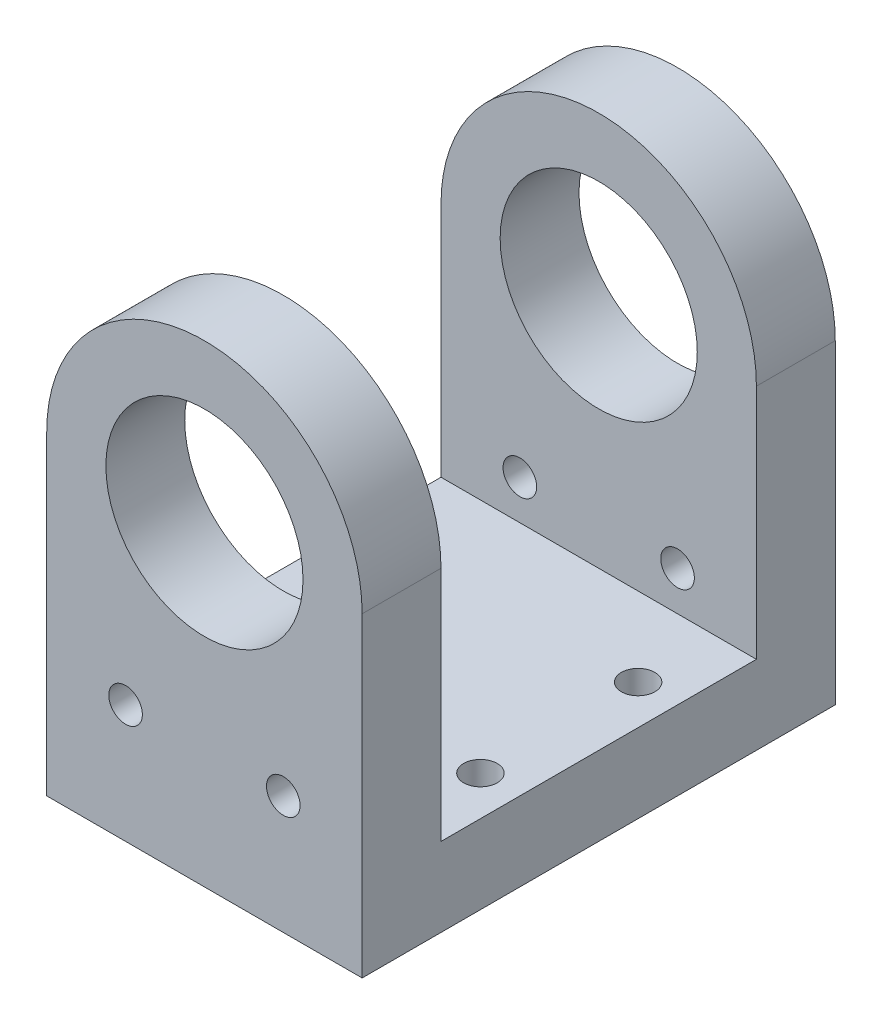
ISO-10303-21;
HEADER;
FILE_DESCRIPTION(('STEP AP214'),'2;1');
FILE_NAME('part.step','',(''),(''),'','','');
FILE_SCHEMA(('AUTOMOTIVE_DESIGN { 1 0 10303 214 1 1 1 1 }'));
ENDSEC;
DATA;
#1=APPLICATION_CONTEXT('core data for automotive mechanical design processes');
#2=APPLICATION_PROTOCOL_DEFINITION('international standard','automotive_design',2000,#1);
#3=PRODUCT_CONTEXT('',#1,'mechanical');
#4=PRODUCT('Part','Part','',(#3));
#5=PRODUCT_RELATED_PRODUCT_CATEGORY('part','',(#4));
#6=PRODUCT_DEFINITION_FORMATION('','',#4);
#7=PRODUCT_DEFINITION_CONTEXT('part definition',#1,'design');
#8=PRODUCT_DEFINITION('design','',#6,#7);
#9=PRODUCT_DEFINITION_SHAPE('','',#8);
#10=(LENGTH_UNIT() NAMED_UNIT(*) SI_UNIT(.MILLI.,.METRE.));
#11=(NAMED_UNIT(*) PLANE_ANGLE_UNIT() SI_UNIT($,.RADIAN.));
#12=(NAMED_UNIT(*) SI_UNIT($,.STERADIAN.) SOLID_ANGLE_UNIT());
#13=UNCERTAINTY_MEASURE_WITH_UNIT(LENGTH_MEASURE(1.E-05),#10,'distance_accuracy_value','');
#14=(GEOMETRIC_REPRESENTATION_CONTEXT(3) GLOBAL_UNCERTAINTY_ASSIGNED_CONTEXT((#13)) GLOBAL_UNIT_ASSIGNED_CONTEXT((#10,
#11,#12)) REPRESENTATION_CONTEXT('',''));
#15=CARTESIAN_POINT('',(0.,0.,0.));
#16=DIRECTION('',(0.,0.,1.));
#17=DIRECTION('',(1.,0.,0.));
#18=AXIS2_PLACEMENT_3D('',#15,#16,#17);
#19=CARTESIAN_POINT('',(0.,25.4,19.05));
#20=DIRECTION('',(0.,0.,1.));
#21=DIRECTION('',(1.,0.,0.));
#22=AXIS2_PLACEMENT_3D('',#19,#20,#21);
#23=PLANE('',#22);
#24=CARTESIAN_POINT('',(6.35,9.525,19.05));
#25=DIRECTION('',(0.,0.,-1.));
#26=DIRECTION('',(-1.,0.,0.));
#27=AXIS2_PLACEMENT_3D('',#24,#25,#26);
#28=CIRCLE('',#27,1.35254999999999);
#29=CARTESIAN_POINT('',(4.99745000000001,9.525,19.05));
#30=VERTEX_POINT('',#29);
#31=EDGE_CURVE('E207',#30,#30,#28,.T.);
#32=ORIENTED_EDGE('',*,*,#31,.T.);
#33=EDGE_LOOP('',(#32));
#34=FACE_BOUND('',#33,.T.);
#35=DIRECTION('',(0.,-1.,0.));
#36=VECTOR('',#35,1.);
#37=CARTESIAN_POINT('',(-12.7,0.,19.05));
#38=LINE('',#37,#36);
#39=CARTESIAN_POINT('',(-12.7,25.4,19.05));
#40=VERTEX_POINT('',#39);
#41=CARTESIAN_POINT('',(-12.7,0.,19.05));
#42=VERTEX_POINT('',#41);
#43=EDGE_CURVE('E164',#40,#42,#38,.T.);
#44=ORIENTED_EDGE('',*,*,#43,.T.);
#45=DIRECTION('',(1.,0.,0.));
#46=VECTOR('',#45,1.);
#47=CARTESIAN_POINT('',(12.7,0.,19.05));
#48=LINE('',#47,#46);
#49=CARTESIAN_POINT('',(12.7,0.,19.05));
#50=VERTEX_POINT('',#49);
#51=EDGE_CURVE('E166',#42,#50,#48,.T.);
#52=ORIENTED_EDGE('',*,*,#51,.T.);
#53=DIRECTION('',(0.,1.,0.));
#54=VECTOR('',#53,1.);
#55=CARTESIAN_POINT('',(12.7,0.,19.05));
#56=LINE('',#55,#54);
#57=CARTESIAN_POINT('',(12.7,25.4,19.05));
#58=VERTEX_POINT('',#57);
#59=EDGE_CURVE('E168',#50,#58,#56,.T.);
#60=ORIENTED_EDGE('',*,*,#59,.T.);
#61=CARTESIAN_POINT('',(0.,25.4,19.05));
#62=DIRECTION('',(0.,0.,1.));
#63=DIRECTION('',(1.,0.,0.));
#64=AXIS2_PLACEMENT_3D('',#61,#62,#63);
#65=CIRCLE('',#64,12.7);
#66=EDGE_CURVE('E65',#58,#40,#65,.T.);
#67=ORIENTED_EDGE('',*,*,#66,.T.);
#68=EDGE_LOOP('',(#44,#52,#60,#67));
#69=FACE_BOUND('',#68,.T.);
#70=CARTESIAN_POINT('',(0.,25.4,19.05));
#71=DIRECTION('',(0.,0.,1.));
#72=DIRECTION('',(1.,0.,0.));
#73=AXIS2_PLACEMENT_3D('',#70,#71,#72);
#74=CIRCLE('',#73,7.9375);
#75=CARTESIAN_POINT('',(-7.9375,25.4,19.05));
#76=VERTEX_POINT('',#75);
#77=EDGE_CURVE('E150',#76,#76,#74,.T.);
#78=ORIENTED_EDGE('',*,*,#77,.F.);
#79=EDGE_LOOP('',(#78));
#80=FACE_BOUND('',#79,.T.);
#81=CARTESIAN_POINT('',(-6.35,9.525,19.05));
#82=DIRECTION('',(0.,0.,-1.));
#83=DIRECTION('',(-1.,0.,0.));
#84=AXIS2_PLACEMENT_3D('',#81,#82,#83);
#85=CIRCLE('',#84,1.35254999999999);
#86=CARTESIAN_POINT('',(-7.70254999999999,9.525,19.05));
#87=VERTEX_POINT('',#86);
#88=EDGE_CURVE('E257',#87,#87,#85,.T.);
#89=ORIENTED_EDGE('',*,*,#88,.T.);
#90=EDGE_LOOP('',(#89));
#91=FACE_BOUND('',#90,.T.);
#92=ADVANCED_FACE('F40',(#34,#69,#80,#91),#23,.T.);
#93=CARTESIAN_POINT('',(0.,25.4,19.05));
#94=DIRECTION('',(0.,0.,-1.));
#95=DIRECTION('',(-1.,0.,0.));
#96=AXIS2_PLACEMENT_3D('',#93,#94,#95);
#97=CYLINDRICAL_SURFACE('',#96,12.7);
#98=DIRECTION('',(0.,0.,-1.));
#99=VECTOR('',#98,1.);
#100=CARTESIAN_POINT('',(12.7,25.4,19.05));
#101=LINE('',#100,#99);
#102=CARTESIAN_POINT('',(12.7,25.4,12.7));
#103=VERTEX_POINT('',#102);
#104=EDGE_CURVE('E176',#58,#103,#101,.T.);
#105=ORIENTED_EDGE('',*,*,#104,.T.);
#106=CARTESIAN_POINT('',(0.,25.4,12.7));
#107=DIRECTION('',(0.,0.,1.));
#108=DIRECTION('',(1.,0.,0.));
#109=AXIS2_PLACEMENT_3D('',#106,#107,#108);
#110=CIRCLE('',#109,12.7);
#111=CARTESIAN_POINT('',(-12.7,25.4,12.7));
#112=VERTEX_POINT('',#111);
#113=EDGE_CURVE('E113',#103,#112,#110,.T.);
#114=ORIENTED_EDGE('',*,*,#113,.T.);
#115=DIRECTION('',(0.,0.,-1.));
#116=VECTOR('',#115,1.);
#117=CARTESIAN_POINT('',(-12.7,25.4,19.05));
#118=LINE('',#117,#116);
#119=EDGE_CURVE('E172',#40,#112,#118,.T.);
#120=ORIENTED_EDGE('',*,*,#119,.F.);
#121=ORIENTED_EDGE('',*,*,#66,.F.);
#122=EDGE_LOOP('',(#105,#114,#120,#121));
#123=FACE_BOUND('',#122,.T.);
#124=ADVANCED_FACE('F248',(#123),#97,.T.);
#125=CARTESIAN_POINT('',(0.,25.4,19.05));
#126=DIRECTION('',(0.,0.,-1.));
#127=DIRECTION('',(-1.,0.,0.));
#128=AXIS2_PLACEMENT_3D('',#125,#126,#127);
#129=CYLINDRICAL_SURFACE('',#128,7.9375);
#130=CARTESIAN_POINT('',(0.,25.4,12.7));
#131=DIRECTION('',(0.,0.,1.));
#132=DIRECTION('',(1.,0.,0.));
#133=AXIS2_PLACEMENT_3D('',#130,#131,#132);
#134=CIRCLE('',#133,7.9375);
#135=CARTESIAN_POINT('',(-7.9375,25.4,12.7));
#136=VERTEX_POINT('',#135);
#137=EDGE_CURVE('E145',#136,#136,#134,.T.);
#138=CARTESIAN_POINT('',(-7.9375,25.4,12.7));
#139=CARTESIAN_POINT('',(-7.9375,25.4,12.7661458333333));
#140=CARTESIAN_POINT('',(-7.9375,25.4,12.8322916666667));
#141=CARTESIAN_POINT('',(-7.9375,25.4,12.9645833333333));
#142=CARTESIAN_POINT('',(-7.9375,25.4,13.0307291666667));
#143=CARTESIAN_POINT('',(-7.9375,25.4,13.1630208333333));
#144=CARTESIAN_POINT('',(-7.9375,25.4,13.2291666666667));
#145=CARTESIAN_POINT('',(-7.9375,25.4,13.3614583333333));
#146=CARTESIAN_POINT('',(-7.9375,25.4,13.4276041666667));
#147=CARTESIAN_POINT('',(-7.9375,25.4,13.5598958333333));
#148=CARTESIAN_POINT('',(-7.9375,25.4,13.6260416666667));
#149=CARTESIAN_POINT('',(-7.9375,25.4,13.7583333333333));
#150=CARTESIAN_POINT('',(-7.9375,25.4,13.8244791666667));
#151=CARTESIAN_POINT('',(-7.9375,25.4,13.9567708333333));
#152=CARTESIAN_POINT('',(-7.9375,25.4,14.0229166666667));
#153=CARTESIAN_POINT('',(-7.9375,25.4,14.1552083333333));
#154=CARTESIAN_POINT('',(-7.9375,25.4,14.2213541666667));
#155=CARTESIAN_POINT('',(-7.9375,25.4,14.3536458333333));
#156=CARTESIAN_POINT('',(-7.9375,25.4,14.4197916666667));
#157=CARTESIAN_POINT('',(-7.9375,25.4,14.5520833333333));
#158=CARTESIAN_POINT('',(-7.9375,25.4,14.6182291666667));
#159=CARTESIAN_POINT('',(-7.9375,25.4,14.7505208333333));
#160=CARTESIAN_POINT('',(-7.9375,25.4,14.8166666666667));
#161=CARTESIAN_POINT('',(-7.9375,25.4,14.9489583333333));
#162=CARTESIAN_POINT('',(-7.9375,25.4,15.0151041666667));
#163=CARTESIAN_POINT('',(-7.9375,25.4,15.1473958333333));
#164=CARTESIAN_POINT('',(-7.9375,25.4,15.2135416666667));
#165=CARTESIAN_POINT('',(-7.9375,25.4,15.3458333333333));
#166=CARTESIAN_POINT('',(-7.9375,25.4,15.4119791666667));
#167=CARTESIAN_POINT('',(-7.9375,25.4,15.5442708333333));
#168=CARTESIAN_POINT('',(-7.9375,25.4,15.6104166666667));
#169=CARTESIAN_POINT('',(-7.9375,25.4,15.7427083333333));
#170=CARTESIAN_POINT('',(-7.9375,25.4,15.8088541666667));
#171=CARTESIAN_POINT('',(-7.9375,25.4,15.9411458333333));
#172=CARTESIAN_POINT('',(-7.9375,25.4,16.0072916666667));
#173=CARTESIAN_POINT('',(-7.9375,25.4,16.1395833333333));
#174=CARTESIAN_POINT('',(-7.9375,25.4,16.2057291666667));
#175=CARTESIAN_POINT('',(-7.9375,25.4,16.3380208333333));
#176=CARTESIAN_POINT('',(-7.9375,25.4,16.4041666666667));
#177=CARTESIAN_POINT('',(-7.9375,25.4,16.5364583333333));
#178=CARTESIAN_POINT('',(-7.9375,25.4,16.6026041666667));
#179=CARTESIAN_POINT('',(-7.9375,25.4,16.7348958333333));
#180=CARTESIAN_POINT('',(-7.9375,25.4,16.8010416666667));
#181=CARTESIAN_POINT('',(-7.9375,25.4,16.9333333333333));
#182=CARTESIAN_POINT('',(-7.9375,25.4,16.9994791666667));
#183=CARTESIAN_POINT('',(-7.9375,25.4,17.1317708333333));
#184=CARTESIAN_POINT('',(-7.9375,25.4,17.1979166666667));
#185=CARTESIAN_POINT('',(-7.9375,25.4,17.3302083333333));
#186=CARTESIAN_POINT('',(-7.9375,25.4,17.3963541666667));
#187=CARTESIAN_POINT('',(-7.9375,25.4,17.5286458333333));
#188=CARTESIAN_POINT('',(-7.9375,25.4,17.5947916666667));
#189=CARTESIAN_POINT('',(-7.9375,25.4,17.7270833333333));
#190=CARTESIAN_POINT('',(-7.9375,25.4,17.7932291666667));
#191=CARTESIAN_POINT('',(-7.9375,25.4,17.9255208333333));
#192=CARTESIAN_POINT('',(-7.9375,25.4,17.9916666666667));
#193=CARTESIAN_POINT('',(-7.9375,25.4,18.1239583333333));
#194=CARTESIAN_POINT('',(-7.9375,25.4,18.1901041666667));
#195=CARTESIAN_POINT('',(-7.9375,25.4,18.3223958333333));
#196=CARTESIAN_POINT('',(-7.9375,25.4,18.3885416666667));
#197=CARTESIAN_POINT('',(-7.9375,25.4,18.5208333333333));
#198=CARTESIAN_POINT('',(-7.9375,25.4,18.5869791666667));
#199=CARTESIAN_POINT('',(-7.9375,25.4,18.7192708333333));
#200=CARTESIAN_POINT('',(-7.9375,25.4,18.7854166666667));
#201=CARTESIAN_POINT('',(-7.9375,25.4,18.9177083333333));
#202=CARTESIAN_POINT('',(-7.9375,25.4,18.9838541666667));
#203=CARTESIAN_POINT('',(-7.9375,25.4,19.05));
#204=B_SPLINE_CURVE_WITH_KNOTS('',3,(#138,#139,#140,#141,#142,#143,#144,#145,#146,#147,#148,
#149,#150,#151,#152,#153,#154,#155,#156,#157,#158,#159,#160,#161,#162,#163,#164,#165,#166,#167,
#168,#169,#170,#171,#172,#173,#174,#175,#176,#177,#178,#179,#180,#181,#182,#183,#184,#185,#186,
#187,#188,#189,#190,#191,#192,#193,#194,#195,#196,#197,#198,#199,#200,#201,#202,#203),
.UNSPECIFIED.,.F.,.F.,(4,2,2,2,2,2,2,2,2,2,2,2,2,2,2,2,2,2,2,2,2,2,2,2,2,2,2,2,2,2,2,2,4),(0.,
0.198437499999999,0.396874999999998,0.5953125,0.793749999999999,0.992187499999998,1.190625,
1.3890625,1.5875,1.7859375,1.984375,2.1828125,2.38125,2.5796875,2.778125,2.9765625,3.175,
3.3734375,3.571875,3.7703125,3.96875,4.1671875,4.365625,4.5640625,4.7625,4.9609375,5.159375,
5.3578125,5.55625,5.7546875,5.953125,6.1515625,6.35),.UNSPECIFIED.);
#205=EDGE_CURVE('BSEAM309',#136,#76,#204,.T.);
#206=ORIENTED_EDGE('',*,*,#137,.F.);
#207=ORIENTED_EDGE('',*,*,#77,.T.);
#208=ORIENTED_EDGE('',*,*,#205,.T.);
#209=ORIENTED_EDGE('',*,*,#205,.F.);
#210=EDGE_LOOP('',(#206,#208,#207,#209));
#211=FACE_BOUND('',#210,.T.);
#212=ADVANCED_FACE('F309',(#211),#129,.F.);
#213=CARTESIAN_POINT('',(0.,25.4,-19.05));
#214=DIRECTION('',(0.,0.,1.));
#215=DIRECTION('',(1.,0.,0.));
#216=AXIS2_PLACEMENT_3D('',#213,#214,#215);
#217=PLANE('',#216);
#218=CARTESIAN_POINT('',(-6.35,9.525,-19.05));
#219=DIRECTION('',(0.,0.,-1.));
#220=DIRECTION('',(-1.,0.,0.));
#221=AXIS2_PLACEMENT_3D('',#218,#219,#220);
#222=CIRCLE('',#221,1.35254999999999);
#223=CARTESIAN_POINT('',(-7.70254999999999,9.525,-19.05));
#224=VERTEX_POINT('',#223);
#225=EDGE_CURVE('E259',#224,#224,#222,.T.);
#226=ORIENTED_EDGE('',*,*,#225,.F.);
#227=EDGE_LOOP('',(#226));
#228=FACE_BOUND('',#227,.T.);
#229=CARTESIAN_POINT('',(6.35,9.525,-19.05));
#230=DIRECTION('',(0.,0.,-1.));
#231=DIRECTION('',(-1.,0.,0.));
#232=AXIS2_PLACEMENT_3D('',#229,#230,#231);
#233=CIRCLE('',#232,1.35254999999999);
#234=CARTESIAN_POINT('',(4.99745000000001,9.525,-19.05));
#235=VERTEX_POINT('',#234);
#236=EDGE_CURVE('E201',#235,#235,#233,.T.);
#237=ORIENTED_EDGE('',*,*,#236,.F.);
#238=EDGE_LOOP('',(#237));
#239=FACE_BOUND('',#238,.T.);
#240=DIRECTION('',(0.,-1.,0.));
#241=VECTOR('',#240,1.);
#242=CARTESIAN_POINT('',(-12.7,0.,-19.05));
#243=LINE('',#242,#241);
#244=CARTESIAN_POINT('',(-12.7,25.4,-19.05));
#245=VERTEX_POINT('',#244);
#246=CARTESIAN_POINT('',(-12.7,0.,-19.05));
#247=VERTEX_POINT('',#246);
#248=EDGE_CURVE('E153',#245,#247,#243,.T.);
#249=ORIENTED_EDGE('',*,*,#248,.F.);
#250=CARTESIAN_POINT('',(0.,25.4,-19.05));
#251=DIRECTION('',(0.,0.,1.));
#252=DIRECTION('',(1.,0.,0.));
#253=AXIS2_PLACEMENT_3D('',#250,#251,#252);
#254=CIRCLE('',#253,12.7);
#255=CARTESIAN_POINT('',(12.7,25.4,-19.05));
#256=VERTEX_POINT('',#255);
#257=EDGE_CURVE('E161',#256,#245,#254,.T.);
#258=ORIENTED_EDGE('',*,*,#257,.F.);
#259=DIRECTION('',(0.,1.,0.));
#260=VECTOR('',#259,1.);
#261=CARTESIAN_POINT('',(12.7,0.,-19.05));
#262=LINE('',#261,#260);
#263=CARTESIAN_POINT('',(12.7,0.,-19.05));
#264=VERTEX_POINT('',#263);
#265=EDGE_CURVE('E158',#264,#256,#262,.T.);
#266=ORIENTED_EDGE('',*,*,#265,.F.);
#267=DIRECTION('',(1.,0.,0.));
#268=VECTOR('',#267,1.);
#269=CARTESIAN_POINT('',(12.7,0.,-19.05));
#270=LINE('',#269,#268);
#271=EDGE_CURVE('E156',#247,#264,#270,.T.);
#272=ORIENTED_EDGE('',*,*,#271,.F.);
#273=EDGE_LOOP('',(#249,#258,#266,#272));
#274=FACE_BOUND('',#273,.T.);
#275=CARTESIAN_POINT('',(0.,25.4,-19.05));
#276=DIRECTION('',(0.,0.,1.));
#277=DIRECTION('',(1.,0.,0.));
#278=AXIS2_PLACEMENT_3D('',#275,#276,#277);
#279=CIRCLE('',#278,7.9375);
#280=CARTESIAN_POINT('',(-7.9375,25.4,-19.05));
#281=VERTEX_POINT('',#280);
#282=EDGE_CURVE('E147',#281,#281,#279,.T.);
#283=ORIENTED_EDGE('',*,*,#282,.T.);
#284=EDGE_LOOP('',(#283));
#285=FACE_BOUND('',#284,.T.);
#286=ADVANCED_FACE('F238',(#228,#239,#274,#285),#217,.F.);
#287=CARTESIAN_POINT('',(-12.7,0.,19.05));
#288=DIRECTION('',(1.,0.,0.));
#289=DIRECTION('',(0.,0.,-1.));
#290=AXIS2_PLACEMENT_3D('',#287,#288,#289);
#291=PLANE('',#290);
#292=ORIENTED_EDGE('',*,*,#119,.T.);
#293=DIRECTION('',(0.,-1.,0.));
#294=VECTOR('',#293,1.);
#295=CARTESIAN_POINT('',(-12.7,6.35,12.7));
#296=LINE('',#295,#294);
#297=CARTESIAN_POINT('',(-12.7,6.35,12.7));
#298=VERTEX_POINT('',#297);
#299=EDGE_CURVE('E133',#112,#298,#296,.T.);
#300=ORIENTED_EDGE('',*,*,#299,.T.);
#301=DIRECTION('',(0.,0.,-1.));
#302=VECTOR('',#301,1.);
#303=CARTESIAN_POINT('',(-12.7,6.35,12.7));
#304=LINE('',#303,#302);
#305=CARTESIAN_POINT('',(-12.7,6.35,-12.7));
#306=VERTEX_POINT('',#305);
#307=EDGE_CURVE('E125',#298,#306,#304,.T.);
#308=ORIENTED_EDGE('',*,*,#307,.T.);
#309=DIRECTION('',(0.,1.,0.));
#310=VECTOR('',#309,1.);
#311=CARTESIAN_POINT('',(-12.7,6.35,-12.7));
#312=LINE('',#311,#310);
#313=CARTESIAN_POINT('',(-12.7,25.4,-12.7));
#314=VERTEX_POINT('',#313);
#315=EDGE_CURVE('E128',#306,#314,#312,.T.);
#316=ORIENTED_EDGE('',*,*,#315,.T.);
#317=EDGE_CURVE('E171',#314,#245,#118,.T.);
#318=ORIENTED_EDGE('',*,*,#317,.T.);
#319=ORIENTED_EDGE('',*,*,#248,.T.);
#320=DIRECTION('',(0.,0.,-1.));
#321=VECTOR('',#320,1.);
#322=CARTESIAN_POINT('',(-12.7,0.,19.05));
#323=LINE('',#322,#321);
#324=EDGE_CURVE('E13',#42,#247,#323,.T.);
#325=ORIENTED_EDGE('',*,*,#324,.F.);
#326=ORIENTED_EDGE('',*,*,#43,.F.);
#327=EDGE_LOOP('',(#292,#300,#308,#316,#318,#319,#325,#326));
#328=FACE_BOUND('',#327,.T.);
#329=ADVANCED_FACE('F42',(#328),#291,.F.);
#330=CARTESIAN_POINT('',(12.7,0.,19.05));
#331=DIRECTION('',(0.,1.,0.));
#332=DIRECTION('',(0.,0.,1.));
#333=AXIS2_PLACEMENT_3D('',#330,#331,#332);
#334=PLANE('',#333);
#335=CARTESIAN_POINT('',(-9.525,0.,-6.35));
#336=DIRECTION('',(0.,-1.,0.));
#337=DIRECTION('',(0.,0.,-1.));
#338=AXIS2_PLACEMENT_3D('',#335,#336,#337);
#339=CIRCLE('',#338,1.35255);
#340=CARTESIAN_POINT('',(-9.525,0.,-7.70255));
#341=VERTEX_POINT('',#340);
#342=EDGE_CURVE('E197',#341,#341,#339,.T.);
#343=ORIENTED_EDGE('',*,*,#342,.F.);
#344=EDGE_LOOP('',(#343));
#345=FACE_BOUND('',#344,.T.);
#346=CARTESIAN_POINT('',(-9.525,0.,6.35));
#347=DIRECTION('',(0.,-1.,0.));
#348=DIRECTION('',(0.,0.,-1.));
#349=AXIS2_PLACEMENT_3D('',#346,#347,#348);
#350=CIRCLE('',#349,1.35255);
#351=CARTESIAN_POINT('',(-9.525,0.,4.99745));
#352=VERTEX_POINT('',#351);
#353=EDGE_CURVE('E194',#352,#352,#350,.T.);
#354=ORIENTED_EDGE('',*,*,#353,.F.);
#355=EDGE_LOOP('',(#354));
#356=FACE_BOUND('',#355,.T.);
#357=CARTESIAN_POINT('',(9.525,0.,-6.35));
#358=DIRECTION('',(0.,-1.,0.));
#359=DIRECTION('',(0.,0.,-1.));
#360=AXIS2_PLACEMENT_3D('',#357,#358,#359);
#361=CIRCLE('',#360,1.35255);
#362=CARTESIAN_POINT('',(9.525,0.,-7.70255));
#363=VERTEX_POINT('',#362);
#364=EDGE_CURVE('E190',#363,#363,#361,.T.);
#365=ORIENTED_EDGE('',*,*,#364,.F.);
#366=EDGE_LOOP('',(#365));
#367=FACE_BOUND('',#366,.T.);
#368=CARTESIAN_POINT('',(9.525,0.,6.35));
#369=DIRECTION('',(0.,-1.,0.));
#370=DIRECTION('',(0.,0.,-1.));
#371=AXIS2_PLACEMENT_3D('',#368,#369,#370);
#372=CIRCLE('',#371,1.35255);
#373=CARTESIAN_POINT('',(9.525,0.,4.99745000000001));
#374=VERTEX_POINT('',#373);
#375=EDGE_CURVE('E186',#374,#374,#372,.T.);
#376=ORIENTED_EDGE('',*,*,#375,.F.);
#377=EDGE_LOOP('',(#376));
#378=FACE_BOUND('',#377,.T.);
#379=ORIENTED_EDGE('',*,*,#271,.T.);
#380=DIRECTION('',(0.,0.,-1.));
#381=VECTOR('',#380,1.);
#382=CARTESIAN_POINT('',(12.7,0.,19.05));
#383=LINE('',#382,#381);
#384=EDGE_CURVE('E49',#50,#264,#383,.T.);
#385=ORIENTED_EDGE('',*,*,#384,.F.);
#386=ORIENTED_EDGE('',*,*,#51,.F.);
#387=ORIENTED_EDGE('',*,*,#324,.T.);
#388=EDGE_LOOP('',(#379,#385,#386,#387));
#389=FACE_BOUND('',#388,.T.);
#390=ADVANCED_FACE('F227',(#345,#356,#367,#378,#389),#334,.F.);
#391=CARTESIAN_POINT('',(12.7,0.,19.05));
#392=DIRECTION('',(-1.,0.,0.));
#393=DIRECTION('',(0.,0.,1.));
#394=AXIS2_PLACEMENT_3D('',#391,#392,#393);
#395=PLANE('',#394);
#396=DIRECTION('',(0.,0.,-1.));
#397=VECTOR('',#396,1.);
#398=CARTESIAN_POINT('',(12.7,6.35,12.7));
#399=LINE('',#398,#397);
#400=CARTESIAN_POINT('',(12.7,6.35,12.7));
#401=VERTEX_POINT('',#400);
#402=CARTESIAN_POINT('',(12.7,6.35,-12.7));
#403=VERTEX_POINT('',#402);
#404=EDGE_CURVE('E118',#401,#403,#399,.T.);
#405=ORIENTED_EDGE('',*,*,#404,.F.);
#406=DIRECTION('',(0.,-1.,0.));
#407=VECTOR('',#406,1.);
#408=CARTESIAN_POINT('',(12.7,6.35,12.7));
#409=LINE('',#408,#407);
#410=EDGE_CURVE('E107',#103,#401,#409,.T.);
#411=ORIENTED_EDGE('',*,*,#410,.F.);
#412=ORIENTED_EDGE('',*,*,#104,.F.);
#413=ORIENTED_EDGE('',*,*,#59,.F.);
#414=ORIENTED_EDGE('',*,*,#384,.T.);
#415=ORIENTED_EDGE('',*,*,#265,.T.);
#416=CARTESIAN_POINT('',(12.7,25.4,-12.7));
#417=VERTEX_POINT('',#416);
#418=EDGE_CURVE('E175',#417,#256,#101,.T.);
#419=ORIENTED_EDGE('',*,*,#418,.F.);
#420=DIRECTION('',(0.,1.,0.));
#421=VECTOR('',#420,1.);
#422=CARTESIAN_POINT('',(12.7,6.35,-12.7));
#423=LINE('',#422,#421);
#424=EDGE_CURVE('E57',#403,#417,#423,.T.);
#425=ORIENTED_EDGE('',*,*,#424,.F.);
#426=EDGE_LOOP('',(#405,#411,#412,#413,#414,#415,#419,#425));
#427=FACE_BOUND('',#426,.T.);
#428=ADVANCED_FACE('F130',(#427),#395,.F.);
#429=ORIENTED_EDGE('',*,*,#317,.F.);
#430=CARTESIAN_POINT('',(0.,25.4,-12.7));
#431=DIRECTION('',(0.,0.,-1.));
#432=DIRECTION('',(-1.,0.,0.));
#433=AXIS2_PLACEMENT_3D('',#430,#431,#432);
#434=CIRCLE('',#433,12.7);
#435=EDGE_CURVE('E143',#314,#417,#434,.T.);
#436=ORIENTED_EDGE('',*,*,#435,.T.);
#437=ORIENTED_EDGE('',*,*,#418,.T.);
#438=ORIENTED_EDGE('',*,*,#257,.T.);
#439=EDGE_LOOP('',(#429,#436,#437,#438));
#440=FACE_BOUND('',#439,.T.);
#441=ADVANCED_FACE('F242',(#440),#97,.T.);
#442=CARTESIAN_POINT('',(0.,25.4,-12.7));
#443=DIRECTION('',(0.,0.,-1.));
#444=DIRECTION('',(-1.,0.,0.));
#445=AXIS2_PLACEMENT_3D('',#442,#443,#444);
#446=CIRCLE('',#445,7.9375);
#447=CARTESIAN_POINT('',(-7.9375,25.4,-12.7));
#448=VERTEX_POINT('',#447);
#449=EDGE_CURVE('E141',#448,#448,#446,.T.);
#450=CARTESIAN_POINT('',(-7.9375,25.4,-12.7));
#451=CARTESIAN_POINT('',(-7.9375,25.4,-12.7661458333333));
#452=CARTESIAN_POINT('',(-7.9375,25.4,-12.8322916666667));
#453=CARTESIAN_POINT('',(-7.9375,25.4,-12.9645833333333));
#454=CARTESIAN_POINT('',(-7.9375,25.4,-13.0307291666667));
#455=CARTESIAN_POINT('',(-7.9375,25.4,-13.1630208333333));
#456=CARTESIAN_POINT('',(-7.9375,25.4,-13.2291666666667));
#457=CARTESIAN_POINT('',(-7.9375,25.4,-13.3614583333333));
#458=CARTESIAN_POINT('',(-7.9375,25.4,-13.4276041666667));
#459=CARTESIAN_POINT('',(-7.9375,25.4,-13.5598958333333));
#460=CARTESIAN_POINT('',(-7.9375,25.4,-13.6260416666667));
#461=CARTESIAN_POINT('',(-7.9375,25.4,-13.7583333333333));
#462=CARTESIAN_POINT('',(-7.9375,25.4,-13.8244791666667));
#463=CARTESIAN_POINT('',(-7.9375,25.4,-13.9567708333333));
#464=CARTESIAN_POINT('',(-7.9375,25.4,-14.0229166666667));
#465=CARTESIAN_POINT('',(-7.9375,25.4,-14.1552083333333));
#466=CARTESIAN_POINT('',(-7.9375,25.4,-14.2213541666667));
#467=CARTESIAN_POINT('',(-7.9375,25.4,-14.3536458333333));
#468=CARTESIAN_POINT('',(-7.9375,25.4,-14.4197916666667));
#469=CARTESIAN_POINT('',(-7.9375,25.4,-14.5520833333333));
#470=CARTESIAN_POINT('',(-7.9375,25.4,-14.6182291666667));
#471=CARTESIAN_POINT('',(-7.9375,25.4,-14.7505208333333));
#472=CARTESIAN_POINT('',(-7.9375,25.4,-14.8166666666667));
#473=CARTESIAN_POINT('',(-7.9375,25.4,-14.9489583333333));
#474=CARTESIAN_POINT('',(-7.9375,25.4,-15.0151041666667));
#475=CARTESIAN_POINT('',(-7.9375,25.4,-15.1473958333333));
#476=CARTESIAN_POINT('',(-7.9375,25.4,-15.2135416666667));
#477=CARTESIAN_POINT('',(-7.9375,25.4,-15.3458333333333));
#478=CARTESIAN_POINT('',(-7.9375,25.4,-15.4119791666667));
#479=CARTESIAN_POINT('',(-7.9375,25.4,-15.5442708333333));
#480=CARTESIAN_POINT('',(-7.9375,25.4,-15.6104166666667));
#481=CARTESIAN_POINT('',(-7.9375,25.4,-15.7427083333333));
#482=CARTESIAN_POINT('',(-7.9375,25.4,-15.8088541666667));
#483=CARTESIAN_POINT('',(-7.9375,25.4,-15.9411458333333));
#484=CARTESIAN_POINT('',(-7.9375,25.4,-16.0072916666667));
#485=CARTESIAN_POINT('',(-7.9375,25.4,-16.1395833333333));
#486=CARTESIAN_POINT('',(-7.9375,25.4,-16.2057291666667));
#487=CARTESIAN_POINT('',(-7.9375,25.4,-16.3380208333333));
#488=CARTESIAN_POINT('',(-7.9375,25.4,-16.4041666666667));
#489=CARTESIAN_POINT('',(-7.9375,25.4,-16.5364583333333));
#490=CARTESIAN_POINT('',(-7.9375,25.4,-16.6026041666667));
#491=CARTESIAN_POINT('',(-7.9375,25.4,-16.7348958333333));
#492=CARTESIAN_POINT('',(-7.9375,25.4,-16.8010416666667));
#493=CARTESIAN_POINT('',(-7.9375,25.4,-16.9333333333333));
#494=CARTESIAN_POINT('',(-7.9375,25.4,-16.9994791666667));
#495=CARTESIAN_POINT('',(-7.9375,25.4,-17.1317708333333));
#496=CARTESIAN_POINT('',(-7.9375,25.4,-17.1979166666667));
#497=CARTESIAN_POINT('',(-7.9375,25.4,-17.3302083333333));
#498=CARTESIAN_POINT('',(-7.9375,25.4,-17.3963541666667));
#499=CARTESIAN_POINT('',(-7.9375,25.4,-17.5286458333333));
#500=CARTESIAN_POINT('',(-7.9375,25.4,-17.5947916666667));
#501=CARTESIAN_POINT('',(-7.9375,25.4,-17.7270833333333));
#502=CARTESIAN_POINT('',(-7.9375,25.4,-17.7932291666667));
#503=CARTESIAN_POINT('',(-7.9375,25.4,-17.9255208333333));
#504=CARTESIAN_POINT('',(-7.9375,25.4,-17.9916666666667));
#505=CARTESIAN_POINT('',(-7.9375,25.4,-18.1239583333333));
#506=CARTESIAN_POINT('',(-7.9375,25.4,-18.1901041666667));
#507=CARTESIAN_POINT('',(-7.9375,25.4,-18.3223958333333));
#508=CARTESIAN_POINT('',(-7.9375,25.4,-18.3885416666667));
#509=CARTESIAN_POINT('',(-7.9375,25.4,-18.5208333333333));
#510=CARTESIAN_POINT('',(-7.9375,25.4,-18.5869791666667));
#511=CARTESIAN_POINT('',(-7.9375,25.4,-18.7192708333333));
#512=CARTESIAN_POINT('',(-7.9375,25.4,-18.7854166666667));
#513=CARTESIAN_POINT('',(-7.9375,25.4,-18.9177083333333));
#514=CARTESIAN_POINT('',(-7.9375,25.4,-18.9838541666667));
#515=CARTESIAN_POINT('',(-7.9375,25.4,-19.05));
#516=B_SPLINE_CURVE_WITH_KNOTS('',3,(#450,#451,#452,#453,#454,#455,#456,#457,#458,#459,#460,
#461,#462,#463,#464,#465,#466,#467,#468,#469,#470,#471,#472,#473,#474,#475,#476,#477,#478,#479,
#480,#481,#482,#483,#484,#485,#486,#487,#488,#489,#490,#491,#492,#493,#494,#495,#496,#497,#498,
#499,#500,#501,#502,#503,#504,#505,#506,#507,#508,#509,#510,#511,#512,#513,#514,#515),
.UNSPECIFIED.,.F.,.F.,(4,2,2,2,2,2,2,2,2,2,2,2,2,2,2,2,2,2,2,2,2,2,2,2,2,2,2,2,2,2,2,2,4),(0.,
0.198437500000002,0.396874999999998,0.5953125,0.793750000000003,0.992187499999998,1.190625,
1.3890625,1.58750000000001,1.7859375,1.984375,2.18281250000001,2.38125,2.5796875,
2.77812500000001,2.9765625,3.175,3.37343750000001,3.571875,3.7703125,3.96875000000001,4.1671875,
4.365625,4.56406250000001,4.7625,4.96093750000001,5.15937500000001,5.3578125,5.55625000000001,
5.75468750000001,5.95312500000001,6.15156250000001,6.35000000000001),.UNSPECIFIED.);
#517=EDGE_CURVE('BSEAM305',#448,#281,#516,.T.);
#518=ORIENTED_EDGE('',*,*,#449,.F.);
#519=ORIENTED_EDGE('',*,*,#282,.F.);
#520=ORIENTED_EDGE('',*,*,#517,.T.);
#521=ORIENTED_EDGE('',*,*,#517,.F.);
#522=EDGE_LOOP('',(#518,#520,#519,#521));
#523=FACE_BOUND('',#522,.T.);
#524=ADVANCED_FACE('F305',(#523),#129,.F.);
#525=CARTESIAN_POINT('',(-12.7,6.35,12.7));
#526=DIRECTION('',(0.,0.,1.));
#527=DIRECTION('',(1.,0.,0.));
#528=AXIS2_PLACEMENT_3D('',#525,#526,#527);
#529=PLANE('',#528);
#530=CARTESIAN_POINT('',(-6.35,9.525,12.7));
#531=DIRECTION('',(0.,0.,1.));
#532=DIRECTION('',(1.,0.,0.));
#533=AXIS2_PLACEMENT_3D('',#530,#531,#532);
#534=CIRCLE('',#533,1.35254999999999);
#535=CARTESIAN_POINT('',(-4.99745000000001,9.525,12.7));
#536=VERTEX_POINT('',#535);
#537=EDGE_CURVE('E212',#536,#536,#534,.T.);
#538=ORIENTED_EDGE('',*,*,#537,.T.);
#539=EDGE_LOOP('',(#538));
#540=FACE_BOUND('',#539,.T.);
#541=CARTESIAN_POINT('',(6.35,9.525,12.7));
#542=DIRECTION('',(0.,0.,1.));
#543=DIRECTION('',(1.,0.,0.));
#544=AXIS2_PLACEMENT_3D('',#541,#542,#543);
#545=CIRCLE('',#544,1.35254999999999);
#546=CARTESIAN_POINT('',(7.70254999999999,9.525,12.7));
#547=VERTEX_POINT('',#546);
#548=EDGE_CURVE('E200',#547,#547,#545,.T.);
#549=ORIENTED_EDGE('',*,*,#548,.T.);
#550=EDGE_LOOP('',(#549));
#551=FACE_BOUND('',#550,.T.);
#552=ORIENTED_EDGE('',*,*,#137,.T.);
#553=EDGE_LOOP('',(#552));
#554=FACE_BOUND('',#553,.T.);
#555=ORIENTED_EDGE('',*,*,#410,.T.);
#556=DIRECTION('',(1.,0.,0.));
#557=VECTOR('',#556,1.);
#558=CARTESIAN_POINT('',(-12.7,6.35,12.7));
#559=LINE('',#558,#557);
#560=EDGE_CURVE('E110',#298,#401,#559,.T.);
#561=ORIENTED_EDGE('',*,*,#560,.F.);
#562=ORIENTED_EDGE('',*,*,#299,.F.);
#563=ORIENTED_EDGE('',*,*,#113,.F.);
#564=EDGE_LOOP('',(#555,#561,#562,#563));
#565=FACE_BOUND('',#564,.T.);
#566=ADVANCED_FACE('F109',(#540,#551,#554,#565),#529,.F.);
#567=CARTESIAN_POINT('',(-12.7,6.35,-12.7));
#568=DIRECTION('',(0.,0.,-1.));
#569=DIRECTION('',(-1.,0.,0.));
#570=AXIS2_PLACEMENT_3D('',#567,#568,#569);
#571=PLANE('',#570);
#572=CARTESIAN_POINT('',(-6.35,9.525,-12.7));
#573=DIRECTION('',(0.,0.,-1.));
#574=DIRECTION('',(-1.,0.,0.));
#575=AXIS2_PLACEMENT_3D('',#572,#573,#574);
#576=CIRCLE('',#575,1.35254999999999);
#577=CARTESIAN_POINT('',(-7.70254999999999,9.525,-12.7));
#578=VERTEX_POINT('',#577);
#579=EDGE_CURVE('E44',#578,#578,#576,.T.);
#580=ORIENTED_EDGE('',*,*,#579,.T.);
#581=EDGE_LOOP('',(#580));
#582=FACE_BOUND('',#581,.T.);
#583=CARTESIAN_POINT('',(6.35,9.525,-12.7));
#584=DIRECTION('',(0.,0.,-1.));
#585=DIRECTION('',(-1.,0.,0.));
#586=AXIS2_PLACEMENT_3D('',#583,#584,#585);
#587=CIRCLE('',#586,1.35254999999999);
#588=CARTESIAN_POINT('',(4.99745000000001,9.525,-12.7));
#589=VERTEX_POINT('',#588);
#590=EDGE_CURVE('E198',#589,#589,#587,.T.);
#591=ORIENTED_EDGE('',*,*,#590,.T.);
#592=EDGE_LOOP('',(#591));
#593=FACE_BOUND('',#592,.T.);
#594=ORIENTED_EDGE('',*,*,#449,.T.);
#595=EDGE_LOOP('',(#594));
#596=FACE_BOUND('',#595,.T.);
#597=ORIENTED_EDGE('',*,*,#315,.F.);
#598=DIRECTION('',(1.,0.,0.));
#599=VECTOR('',#598,1.);
#600=CARTESIAN_POINT('',(-12.7,6.35,-12.7));
#601=LINE('',#600,#599);
#602=EDGE_CURVE('E127',#306,#403,#601,.T.);
#603=ORIENTED_EDGE('',*,*,#602,.T.);
#604=ORIENTED_EDGE('',*,*,#424,.T.);
#605=ORIENTED_EDGE('',*,*,#435,.F.);
#606=EDGE_LOOP('',(#597,#603,#604,#605));
#607=FACE_BOUND('',#606,.T.);
#608=ADVANCED_FACE('F244',(#582,#593,#596,#607),#571,.F.);
#609=CARTESIAN_POINT('',(-12.7,6.35,12.7));
#610=DIRECTION('',(0.,-1.,0.));
#611=DIRECTION('',(0.,0.,-1.));
#612=AXIS2_PLACEMENT_3D('',#609,#610,#611);
#613=PLANE('',#612);
#614=CARTESIAN_POINT('',(-9.525,6.35,-6.35));
#615=DIRECTION('',(0.,-1.,0.));
#616=DIRECTION('',(0.,0.,-1.));
#617=AXIS2_PLACEMENT_3D('',#614,#615,#616);
#618=CIRCLE('',#617,1.35254999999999);
#619=CARTESIAN_POINT('',(-9.525,6.35,-7.70254999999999));
#620=VERTEX_POINT('',#619);
#621=EDGE_CURVE('E195',#620,#620,#618,.T.);
#622=ORIENTED_EDGE('',*,*,#621,.T.);
#623=EDGE_LOOP('',(#622));
#624=FACE_BOUND('',#623,.T.);
#625=CARTESIAN_POINT('',(-9.525,6.35,6.35));
#626=DIRECTION('',(0.,-1.,0.));
#627=DIRECTION('',(0.,0.,-1.));
#628=AXIS2_PLACEMENT_3D('',#625,#626,#627);
#629=CIRCLE('',#628,1.35254999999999);
#630=CARTESIAN_POINT('',(-9.525,6.35,4.99745000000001));
#631=VERTEX_POINT('',#630);
#632=EDGE_CURVE('E191',#631,#631,#629,.T.);
#633=ORIENTED_EDGE('',*,*,#632,.T.);
#634=EDGE_LOOP('',(#633));
#635=FACE_BOUND('',#634,.T.);
#636=CARTESIAN_POINT('',(9.525,6.35,-6.35));
#637=DIRECTION('',(0.,-1.,0.));
#638=DIRECTION('',(0.,0.,-1.));
#639=AXIS2_PLACEMENT_3D('',#636,#637,#638);
#640=CIRCLE('',#639,1.35254999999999);
#641=CARTESIAN_POINT('',(9.525,6.35,-7.70254999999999));
#642=VERTEX_POINT('',#641);
#643=EDGE_CURVE('E187',#642,#642,#640,.T.);
#644=ORIENTED_EDGE('',*,*,#643,.T.);
#645=EDGE_LOOP('',(#644));
#646=FACE_BOUND('',#645,.T.);
#647=CARTESIAN_POINT('',(9.525,6.35,6.35));
#648=DIRECTION('',(0.,-1.,0.));
#649=DIRECTION('',(0.,0.,-1.));
#650=AXIS2_PLACEMENT_3D('',#647,#648,#649);
#651=CIRCLE('',#650,1.35254999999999);
#652=CARTESIAN_POINT('',(9.525,6.35,4.99745000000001));
#653=VERTEX_POINT('',#652);
#654=EDGE_CURVE('E119',#653,#653,#651,.T.);
#655=ORIENTED_EDGE('',*,*,#654,.T.);
#656=EDGE_LOOP('',(#655));
#657=FACE_BOUND('',#656,.T.);
#658=ORIENTED_EDGE('',*,*,#404,.T.);
#659=ORIENTED_EDGE('',*,*,#602,.F.);
#660=ORIENTED_EDGE('',*,*,#307,.F.);
#661=ORIENTED_EDGE('',*,*,#560,.T.);
#662=EDGE_LOOP('',(#658,#659,#660,#661));
#663=FACE_BOUND('',#662,.T.);
#664=ADVANCED_FACE('F123',(#624,#635,#646,#657,#663),#613,.F.);
#665=CARTESIAN_POINT('',(9.525,0.,6.35));
#666=DIRECTION('',(0.,-1.,0.));
#667=DIRECTION('',(0.,0.,-1.));
#668=AXIS2_PLACEMENT_3D('',#665,#666,#667);
#669=CYLINDRICAL_SURFACE('',#668,1.35254999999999);
#670=ORIENTED_EDGE('',*,*,#375,.T.);
#671=EDGE_LOOP('',(#670));
#672=FACE_BOUND('',#671,.T.);
#673=ORIENTED_EDGE('',*,*,#654,.F.);
#674=EDGE_LOOP('',(#673));
#675=FACE_BOUND('',#674,.T.);
#676=ADVANCED_FACE('F224',(#672,#675),#669,.F.);
#677=CARTESIAN_POINT('',(9.525,0.,-6.35));
#678=DIRECTION('',(0.,-1.,0.));
#679=DIRECTION('',(0.,0.,-1.));
#680=AXIS2_PLACEMENT_3D('',#677,#678,#679);
#681=CYLINDRICAL_SURFACE('',#680,1.35254999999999);
#682=ORIENTED_EDGE('',*,*,#364,.T.);
#683=EDGE_LOOP('',(#682));
#684=FACE_BOUND('',#683,.T.);
#685=ORIENTED_EDGE('',*,*,#643,.F.);
#686=EDGE_LOOP('',(#685));
#687=FACE_BOUND('',#686,.T.);
#688=ADVANCED_FACE('F291',(#684,#687),#681,.F.);
#689=CARTESIAN_POINT('',(-9.525,0.,6.35));
#690=DIRECTION('',(0.,-1.,0.));
#691=DIRECTION('',(0.,0.,-1.));
#692=AXIS2_PLACEMENT_3D('',#689,#690,#691);
#693=CYLINDRICAL_SURFACE('',#692,1.35254999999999);
#694=ORIENTED_EDGE('',*,*,#353,.T.);
#695=EDGE_LOOP('',(#694));
#696=FACE_BOUND('',#695,.T.);
#697=ORIENTED_EDGE('',*,*,#632,.F.);
#698=EDGE_LOOP('',(#697));
#699=FACE_BOUND('',#698,.T.);
#700=ADVANCED_FACE('F287',(#696,#699),#693,.F.);
#701=CARTESIAN_POINT('',(-9.525,0.,-6.35));
#702=DIRECTION('',(0.,-1.,0.));
#703=DIRECTION('',(0.,0.,-1.));
#704=AXIS2_PLACEMENT_3D('',#701,#702,#703);
#705=CYLINDRICAL_SURFACE('',#704,1.35254999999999);
#706=ORIENTED_EDGE('',*,*,#342,.T.);
#707=EDGE_LOOP('',(#706));
#708=FACE_BOUND('',#707,.T.);
#709=ORIENTED_EDGE('',*,*,#621,.F.);
#710=EDGE_LOOP('',(#709));
#711=FACE_BOUND('',#710,.T.);
#712=ADVANCED_FACE('F284',(#708,#711),#705,.F.);
#713=CARTESIAN_POINT('',(6.35,9.525,-19.05));
#714=DIRECTION('',(0.,0.,-1.));
#715=DIRECTION('',(-1.,0.,0.));
#716=AXIS2_PLACEMENT_3D('',#713,#714,#715);
#717=CYLINDRICAL_SURFACE('',#716,1.35254999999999);
#718=ORIENTED_EDGE('',*,*,#236,.T.);
#719=EDGE_LOOP('',(#718));
#720=FACE_BOUND('',#719,.T.);
#721=ORIENTED_EDGE('',*,*,#590,.F.);
#722=EDGE_LOOP('',(#721));
#723=FACE_BOUND('',#722,.T.);
#724=ADVANCED_FACE('F280',(#720,#723),#717,.F.);
#725=ORIENTED_EDGE('',*,*,#31,.F.);
#726=EDGE_LOOP('',(#725));
#727=FACE_BOUND('',#726,.T.);
#728=ORIENTED_EDGE('',*,*,#548,.F.);
#729=EDGE_LOOP('',(#728));
#730=FACE_BOUND('',#729,.T.);
#731=ADVANCED_FACE('F273',(#727,#730),#717,.F.);
#732=CARTESIAN_POINT('',(-6.35,9.525,-19.05));
#733=DIRECTION('',(0.,0.,-1.));
#734=DIRECTION('',(-1.,0.,0.));
#735=AXIS2_PLACEMENT_3D('',#732,#733,#734);
#736=CYLINDRICAL_SURFACE('',#735,1.35254999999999);
#737=ORIENTED_EDGE('',*,*,#225,.T.);
#738=EDGE_LOOP('',(#737));
#739=FACE_BOUND('',#738,.T.);
#740=ORIENTED_EDGE('',*,*,#579,.F.);
#741=EDGE_LOOP('',(#740));
#742=FACE_BOUND('',#741,.T.);
#743=ADVANCED_FACE('F270',(#739,#742),#736,.F.);
#744=ORIENTED_EDGE('',*,*,#88,.F.);
#745=EDGE_LOOP('',(#744));
#746=FACE_BOUND('',#745,.T.);
#747=ORIENTED_EDGE('',*,*,#537,.F.);
#748=EDGE_LOOP('',(#747));
#749=FACE_BOUND('',#748,.T.);
#750=ADVANCED_FACE('F272',(#746,#749),#736,.F.);
#751=CLOSED_SHELL('',(#92,#124,#212,#286,#329,#390,#428,#441,#524,#566,#608,#664,#676,#688,#700,
#712,#724,#731,#743,#750));
#752=MANIFOLD_SOLID_BREP('B2',#751);
#753=ADVANCED_BREP_SHAPE_REPRESENTATION('',(#18,#752),#14);
#754=SHAPE_DEFINITION_REPRESENTATION(#9,#753);
ENDSEC;
END-ISO-10303-21;
